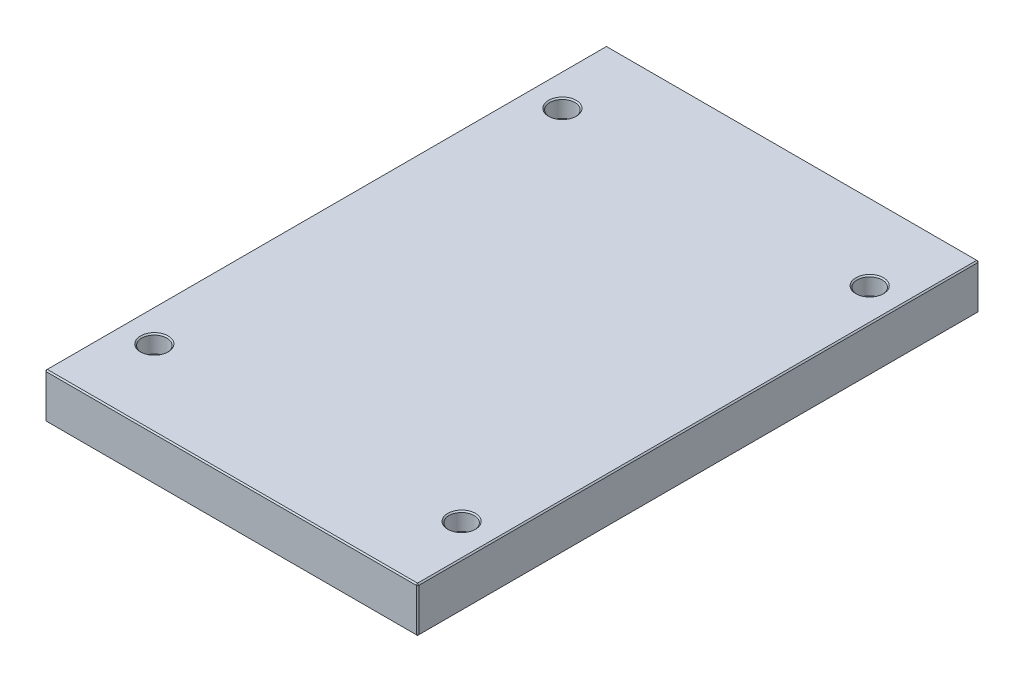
ISO-10303-21;
HEADER;
FILE_DESCRIPTION(('STEP AP214'),'2;1');
FILE_NAME('part.step','',(''),(''),'','','');
FILE_SCHEMA(('AUTOMOTIVE_DESIGN { 1 0 10303 214 1 1 1 1 }'));
ENDSEC;
DATA;
#1=APPLICATION_CONTEXT('core data for automotive mechanical design processes');
#2=APPLICATION_PROTOCOL_DEFINITION('international standard','automotive_design',2000,#1);
#3=PRODUCT_CONTEXT('',#1,'mechanical');
#4=PRODUCT('Part','Part','',(#3));
#5=PRODUCT_RELATED_PRODUCT_CATEGORY('part','',(#4));
#6=PRODUCT_DEFINITION_FORMATION('','',#4);
#7=PRODUCT_DEFINITION_CONTEXT('part definition',#1,'design');
#8=PRODUCT_DEFINITION('design','',#6,#7);
#9=PRODUCT_DEFINITION_SHAPE('','',#8);
#10=(LENGTH_UNIT() NAMED_UNIT(*) SI_UNIT(.MILLI.,.METRE.));
#11=(NAMED_UNIT(*) PLANE_ANGLE_UNIT() SI_UNIT($,.RADIAN.));
#12=(NAMED_UNIT(*) SI_UNIT($,.STERADIAN.) SOLID_ANGLE_UNIT());
#13=UNCERTAINTY_MEASURE_WITH_UNIT(LENGTH_MEASURE(1.E-05),#10,'distance_accuracy_value','');
#14=(GEOMETRIC_REPRESENTATION_CONTEXT(3) GLOBAL_UNCERTAINTY_ASSIGNED_CONTEXT((#13)) GLOBAL_UNIT_ASSIGNED_CONTEXT((#10,
#11,#12)) REPRESENTATION_CONTEXT('',''));
#15=CARTESIAN_POINT('',(0.,0.,0.));
#16=DIRECTION('',(0.,0.,1.));
#17=DIRECTION('',(1.,0.,0.));
#18=AXIS2_PLACEMENT_3D('',#15,#16,#17);
#19=CARTESIAN_POINT('',(-148.,36.,223.));
#20=DIRECTION('',(1.,0.,0.));
#21=DIRECTION('',(0.,0.,-1.));
#22=AXIS2_PLACEMENT_3D('',#19,#20,#21);
#23=PLANE('',#22);
#24=DIRECTION('',(0.,-1.,0.));
#25=VECTOR('',#24,1.);
#26=CARTESIAN_POINT('',(-148.,36.,-222.));
#27=LINE('',#26,#25);
#28=CARTESIAN_POINT('',(-148.,35.,-222.));
#29=VERTEX_POINT('',#28);
#30=CARTESIAN_POINT('',(-148.,1.,-222.));
#31=VERTEX_POINT('',#30);
#32=EDGE_CURVE('E115',#29,#31,#27,.T.);
#33=ORIENTED_EDGE('',*,*,#32,.T.);
#34=DIRECTION('',(0.,0.,1.));
#35=VECTOR('',#34,1.);
#36=CARTESIAN_POINT('',(-148.,1.,223.));
#37=LINE('',#36,#35);
#38=CARTESIAN_POINT('',(-148.,1.,222.));
#39=VERTEX_POINT('',#38);
#40=EDGE_CURVE('E111',#31,#39,#37,.T.);
#41=ORIENTED_EDGE('',*,*,#40,.T.);
#42=DIRECTION('',(0.,1.,0.));
#43=VECTOR('',#42,1.);
#44=CARTESIAN_POINT('',(-148.,36.,222.));
#45=LINE('',#44,#43);
#46=CARTESIAN_POINT('',(-148.,35.,222.));
#47=VERTEX_POINT('',#46);
#48=EDGE_CURVE('E104',#39,#47,#45,.T.);
#49=ORIENTED_EDGE('',*,*,#48,.T.);
#50=DIRECTION('',(0.,0.,-1.));
#51=VECTOR('',#50,1.);
#52=CARTESIAN_POINT('',(-148.,35.,-223.));
#53=LINE('',#52,#51);
#54=EDGE_CURVE('E108',#47,#29,#53,.T.);
#55=ORIENTED_EDGE('',*,*,#54,.T.);
#56=EDGE_LOOP('',(#33,#41,#49,#55));
#57=FACE_BOUND('',#56,.T.);
#58=ADVANCED_FACE('F16',(#57),#23,.F.);
#59=CARTESIAN_POINT('',(148.,36.,223.));
#60=DIRECTION('',(0.,0.,-1.));
#61=DIRECTION('',(-1.,0.,0.));
#62=AXIS2_PLACEMENT_3D('',#59,#60,#61);
#63=PLANE('',#62);
#64=DIRECTION('',(-1.,0.,0.));
#65=VECTOR('',#64,1.);
#66=CARTESIAN_POINT('',(-148.,35.,223.));
#67=LINE('',#66,#65);
#68=CARTESIAN_POINT('',(147.,35.,223.));
#69=VERTEX_POINT('',#68);
#70=CARTESIAN_POINT('',(-147.,35.,223.));
#71=VERTEX_POINT('',#70);
#72=EDGE_CURVE('E170',#69,#71,#67,.T.);
#73=ORIENTED_EDGE('',*,*,#72,.T.);
#74=DIRECTION('',(0.,-1.,0.));
#75=VECTOR('',#74,1.);
#76=CARTESIAN_POINT('',(-147.,36.,223.));
#77=LINE('',#76,#75);
#78=CARTESIAN_POINT('',(-147.,1.00000000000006,223.));
#79=VERTEX_POINT('',#78);
#80=EDGE_CURVE('E123',#71,#79,#77,.T.);
#81=ORIENTED_EDGE('',*,*,#80,.T.);
#82=DIRECTION('',(1.,0.,0.));
#83=VECTOR('',#82,1.);
#84=CARTESIAN_POINT('',(148.,1.00000000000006,223.));
#85=LINE('',#84,#83);
#86=CARTESIAN_POINT('',(147.,1.00000000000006,223.));
#87=VERTEX_POINT('',#86);
#88=EDGE_CURVE('E174',#79,#87,#85,.T.);
#89=ORIENTED_EDGE('',*,*,#88,.T.);
#90=DIRECTION('',(0.,1.,0.));
#91=VECTOR('',#90,1.);
#92=CARTESIAN_POINT('',(147.,36.,223.));
#93=LINE('',#92,#91);
#94=EDGE_CURVE('E172',#87,#69,#93,.T.);
#95=ORIENTED_EDGE('',*,*,#94,.T.);
#96=EDGE_LOOP('',(#73,#81,#89,#95));
#97=FACE_BOUND('',#96,.T.);
#98=ADVANCED_FACE('F317',(#97),#63,.F.);
#99=CARTESIAN_POINT('',(148.,36.,223.));
#100=DIRECTION('',(-1.,0.,0.));
#101=DIRECTION('',(0.,0.,1.));
#102=AXIS2_PLACEMENT_3D('',#99,#100,#101);
#103=PLANE('',#102);
#104=DIRECTION('',(0.,0.,-1.));
#105=VECTOR('',#104,1.);
#106=CARTESIAN_POINT('',(148.,1.00000000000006,223.));
#107=LINE('',#106,#105);
#108=CARTESIAN_POINT('',(148.,1.00000000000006,222.));
#109=VERTEX_POINT('',#108);
#110=CARTESIAN_POINT('',(148.,1.00000000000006,-222.));
#111=VERTEX_POINT('',#110);
#112=EDGE_CURVE('E165',#109,#111,#107,.T.);
#113=ORIENTED_EDGE('',*,*,#112,.T.);
#114=DIRECTION('',(0.,1.,0.));
#115=VECTOR('',#114,1.);
#116=CARTESIAN_POINT('',(148.,36.,-222.));
#117=LINE('',#116,#115);
#118=CARTESIAN_POINT('',(148.,35.,-222.));
#119=VERTEX_POINT('',#118);
#120=EDGE_CURVE('E167',#111,#119,#117,.T.);
#121=ORIENTED_EDGE('',*,*,#120,.T.);
#122=DIRECTION('',(0.,0.,1.));
#123=VECTOR('',#122,1.);
#124=CARTESIAN_POINT('',(148.,35.,223.));
#125=LINE('',#124,#123);
#126=CARTESIAN_POINT('',(148.,35.,222.));
#127=VERTEX_POINT('',#126);
#128=EDGE_CURVE('E161',#119,#127,#125,.T.);
#129=ORIENTED_EDGE('',*,*,#128,.T.);
#130=DIRECTION('',(0.,-1.,0.));
#131=VECTOR('',#130,1.);
#132=CARTESIAN_POINT('',(148.,36.,222.));
#133=LINE('',#132,#131);
#134=EDGE_CURVE('E163',#127,#109,#133,.T.);
#135=ORIENTED_EDGE('',*,*,#134,.T.);
#136=EDGE_LOOP('',(#113,#121,#129,#135));
#137=FACE_BOUND('',#136,.T.);
#138=ADVANCED_FACE('F323',(#137),#103,.F.);
#139=CARTESIAN_POINT('',(148.,36.,-223.));
#140=DIRECTION('',(0.,0.,1.));
#141=DIRECTION('',(1.,0.,0.));
#142=AXIS2_PLACEMENT_3D('',#139,#140,#141);
#143=PLANE('',#142);
#144=DIRECTION('',(0.,-1.,0.));
#145=VECTOR('',#144,1.);
#146=CARTESIAN_POINT('',(147.,36.,-223.));
#147=LINE('',#146,#145);
#148=CARTESIAN_POINT('',(147.,35.,-223.));
#149=VERTEX_POINT('',#148);
#150=CARTESIAN_POINT('',(147.,1.00000000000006,-223.));
#151=VERTEX_POINT('',#150);
#152=EDGE_CURVE('E154',#149,#151,#147,.T.);
#153=ORIENTED_EDGE('',*,*,#152,.T.);
#154=DIRECTION('',(-1.,0.,0.));
#155=VECTOR('',#154,1.);
#156=CARTESIAN_POINT('',(148.,1.00000000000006,-223.));
#157=LINE('',#156,#155);
#158=CARTESIAN_POINT('',(-147.,1.00000000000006,-223.));
#159=VERTEX_POINT('',#158);
#160=EDGE_CURVE('E159',#151,#159,#157,.T.);
#161=ORIENTED_EDGE('',*,*,#160,.T.);
#162=DIRECTION('',(0.,1.,0.));
#163=VECTOR('',#162,1.);
#164=CARTESIAN_POINT('',(-147.,36.,-223.));
#165=LINE('',#164,#163);
#166=CARTESIAN_POINT('',(-147.,35.,-223.));
#167=VERTEX_POINT('',#166);
#168=EDGE_CURVE('E156',#159,#167,#165,.T.);
#169=ORIENTED_EDGE('',*,*,#168,.T.);
#170=DIRECTION('',(1.,0.,0.));
#171=VECTOR('',#170,1.);
#172=CARTESIAN_POINT('',(148.,35.,-223.));
#173=LINE('',#172,#171);
#174=EDGE_CURVE('E152',#167,#149,#173,.T.);
#175=ORIENTED_EDGE('',*,*,#174,.T.);
#176=EDGE_LOOP('',(#153,#161,#169,#175));
#177=FACE_BOUND('',#176,.T.);
#178=ADVANCED_FACE('F465',(#177),#143,.F.);
#179=CARTESIAN_POINT('',(0.,36.,0.));
#180=DIRECTION('',(0.,1.,0.));
#181=DIRECTION('',(0.,0.,1.));
#182=AXIS2_PLACEMENT_3D('',#179,#180,#181);
#183=PLANE('',#182);
#184=CARTESIAN_POINT('',(-122.,36.,162.));
#185=DIRECTION('',(0.,1.,0.));
#186=DIRECTION('',(0.,0.,1.));
#187=AXIS2_PLACEMENT_3D('',#184,#185,#186);
#188=CIRCLE('',#187,11.);
#189=CARTESIAN_POINT('',(-122.,36.,173.));
#190=VERTEX_POINT('',#189);
#191=EDGE_CURVE('E290',#190,#190,#188,.F.);
#192=ORIENTED_EDGE('',*,*,#191,.T.);
#193=EDGE_LOOP('',(#192));
#194=FACE_BOUND('',#193,.T.);
#195=CARTESIAN_POINT('',(122.,36.,162.));
#196=DIRECTION('',(0.,1.,0.));
#197=DIRECTION('',(0.,0.,1.));
#198=AXIS2_PLACEMENT_3D('',#195,#196,#197);
#199=CIRCLE('',#198,11.);
#200=CARTESIAN_POINT('',(122.,36.,173.));
#201=VERTEX_POINT('',#200);
#202=EDGE_CURVE('E287',#201,#201,#199,.F.);
#203=ORIENTED_EDGE('',*,*,#202,.T.);
#204=EDGE_LOOP('',(#203));
#205=FACE_BOUND('',#204,.T.);
#206=CARTESIAN_POINT('',(122.,36.,-162.));
#207=DIRECTION('',(0.,1.,0.));
#208=DIRECTION('',(0.,0.,1.));
#209=AXIS2_PLACEMENT_3D('',#206,#207,#208);
#210=CIRCLE('',#209,11.);
#211=CARTESIAN_POINT('',(122.,36.,-151.));
#212=VERTEX_POINT('',#211);
#213=EDGE_CURVE('E284',#212,#212,#210,.F.);
#214=ORIENTED_EDGE('',*,*,#213,.T.);
#215=EDGE_LOOP('',(#214));
#216=FACE_BOUND('',#215,.T.);
#217=CARTESIAN_POINT('',(-122.,36.,-162.));
#218=DIRECTION('',(0.,1.,0.));
#219=DIRECTION('',(0.,0.,1.));
#220=AXIS2_PLACEMENT_3D('',#217,#218,#219);
#221=CIRCLE('',#220,11.);
#222=CARTESIAN_POINT('',(-122.,36.,-151.));
#223=VERTEX_POINT('',#222);
#224=EDGE_CURVE('E281',#223,#223,#221,.F.);
#225=ORIENTED_EDGE('',*,*,#224,.T.);
#226=EDGE_LOOP('',(#225));
#227=FACE_BOUND('',#226,.T.);
#228=DIRECTION('',(0.,0.,-1.));
#229=VECTOR('',#228,1.);
#230=CARTESIAN_POINT('',(147.,36.,-223.));
#231=LINE('',#230,#229);
#232=CARTESIAN_POINT('',(147.,36.,222.));
#233=VERTEX_POINT('',#232);
#234=CARTESIAN_POINT('',(147.,36.,-222.));
#235=VERTEX_POINT('',#234);
#236=EDGE_CURVE('E31',#233,#235,#231,.T.);
#237=ORIENTED_EDGE('',*,*,#236,.T.);
#238=DIRECTION('',(-1.,0.,0.));
#239=VECTOR('',#238,1.);
#240=CARTESIAN_POINT('',(-148.,36.,-222.));
#241=LINE('',#240,#239);
#242=CARTESIAN_POINT('',(-147.,36.,-222.));
#243=VERTEX_POINT('',#242);
#244=EDGE_CURVE('E190',#235,#243,#241,.T.);
#245=ORIENTED_EDGE('',*,*,#244,.T.);
#246=DIRECTION('',(0.,0.,1.));
#247=VECTOR('',#246,1.);
#248=CARTESIAN_POINT('',(-147.,36.,223.));
#249=LINE('',#248,#247);
#250=CARTESIAN_POINT('',(-147.,36.,222.));
#251=VERTEX_POINT('',#250);
#252=EDGE_CURVE('E186',#243,#251,#249,.T.);
#253=ORIENTED_EDGE('',*,*,#252,.T.);
#254=DIRECTION('',(1.,0.,0.));
#255=VECTOR('',#254,1.);
#256=CARTESIAN_POINT('',(148.,36.,222.));
#257=LINE('',#256,#255);
#258=EDGE_CURVE('E36',#251,#233,#257,.T.);
#259=ORIENTED_EDGE('',*,*,#258,.T.);
#260=EDGE_LOOP('',(#237,#245,#253,#259));
#261=FACE_BOUND('',#260,.T.);
#262=ADVANCED_FACE('F462',(#194,#205,#216,#227,#261),#183,.T.);
#263=CARTESIAN_POINT('',(0.,0.,0.));
#264=DIRECTION('',(0.,1.,0.));
#265=DIRECTION('',(0.,0.,1.));
#266=AXIS2_PLACEMENT_3D('',#263,#264,#265);
#267=PLANE('',#266);
#268=CARTESIAN_POINT('',(122.,0.,-162.));
#269=DIRECTION('',(0.,1.,0.));
#270=DIRECTION('',(0.,0.,1.));
#271=AXIS2_PLACEMENT_3D('',#268,#269,#270);
#272=CIRCLE('',#271,8.);
#273=CARTESIAN_POINT('',(122.,0.,-154.));
#274=VERTEX_POINT('',#273);
#275=EDGE_CURVE('E263',#274,#274,#272,.T.);
#276=ORIENTED_EDGE('',*,*,#275,.T.);
#277=EDGE_LOOP('',(#276));
#278=FACE_BOUND('',#277,.T.);
#279=CARTESIAN_POINT('',(122.,0.,162.));
#280=DIRECTION('',(0.,1.,0.));
#281=DIRECTION('',(0.,0.,1.));
#282=AXIS2_PLACEMENT_3D('',#279,#280,#281);
#283=CIRCLE('',#282,8.);
#284=CARTESIAN_POINT('',(122.,0.,170.));
#285=VERTEX_POINT('',#284);
#286=EDGE_CURVE('E260',#285,#285,#283,.T.);
#287=ORIENTED_EDGE('',*,*,#286,.T.);
#288=EDGE_LOOP('',(#287));
#289=FACE_BOUND('',#288,.T.);
#290=CARTESIAN_POINT('',(-122.,0.,162.));
#291=DIRECTION('',(0.,1.,0.));
#292=DIRECTION('',(0.,0.,1.));
#293=AXIS2_PLACEMENT_3D('',#290,#291,#292);
#294=CIRCLE('',#293,8.);
#295=CARTESIAN_POINT('',(-122.,0.,170.));
#296=VERTEX_POINT('',#295);
#297=EDGE_CURVE('E257',#296,#296,#294,.T.);
#298=ORIENTED_EDGE('',*,*,#297,.T.);
#299=EDGE_LOOP('',(#298));
#300=FACE_BOUND('',#299,.T.);
#301=CARTESIAN_POINT('',(-122.,0.,-162.));
#302=DIRECTION('',(0.,1.,0.));
#303=DIRECTION('',(0.,0.,1.));
#304=AXIS2_PLACEMENT_3D('',#301,#302,#303);
#305=CIRCLE('',#304,8.);
#306=CARTESIAN_POINT('',(-122.,0.,-154.));
#307=VERTEX_POINT('',#306);
#308=EDGE_CURVE('E192',#307,#307,#305,.T.);
#309=ORIENTED_EDGE('',*,*,#308,.T.);
#310=EDGE_LOOP('',(#309));
#311=FACE_BOUND('',#310,.T.);
#312=DIRECTION('',(0.,0.,1.));
#313=VECTOR('',#312,1.);
#314=CARTESIAN_POINT('',(147.,0.,0.));
#315=LINE('',#314,#313);
#316=CARTESIAN_POINT('',(147.,0.,-222.));
#317=VERTEX_POINT('',#316);
#318=CARTESIAN_POINT('',(147.,0.,222.));
#319=VERTEX_POINT('',#318);
#320=EDGE_CURVE('E177',#317,#319,#315,.T.);
#321=ORIENTED_EDGE('',*,*,#320,.T.);
#322=DIRECTION('',(-1.,0.,0.));
#323=VECTOR('',#322,1.);
#324=CARTESIAN_POINT('',(0.,0.,222.));
#325=LINE('',#324,#323);
#326=CARTESIAN_POINT('',(-147.,0.,222.));
#327=VERTEX_POINT('',#326);
#328=EDGE_CURVE('E183',#319,#327,#325,.T.);
#329=ORIENTED_EDGE('',*,*,#328,.T.);
#330=DIRECTION('',(0.,0.,-1.));
#331=VECTOR('',#330,1.);
#332=CARTESIAN_POINT('',(-147.,0.,0.));
#333=LINE('',#332,#331);
#334=CARTESIAN_POINT('',(-147.,0.,-222.));
#335=VERTEX_POINT('',#334);
#336=EDGE_CURVE('E181',#327,#335,#333,.T.);
#337=ORIENTED_EDGE('',*,*,#336,.T.);
#338=DIRECTION('',(1.,0.,0.));
#339=VECTOR('',#338,1.);
#340=CARTESIAN_POINT('',(0.,0.,-222.));
#341=LINE('',#340,#339);
#342=EDGE_CURVE('E179',#335,#317,#341,.T.);
#343=ORIENTED_EDGE('',*,*,#342,.T.);
#344=EDGE_LOOP('',(#321,#329,#337,#343));
#345=FACE_BOUND('',#344,.T.);
#346=ADVANCED_FACE('F402',(#278,#289,#300,#311,#345),#267,.F.);
#347=CARTESIAN_POINT('',(148.,36.,222.));
#348=DIRECTION('',(-0.707106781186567,0.,-0.707106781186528));
#349=DIRECTION('',(0.,-1.,0.));
#350=AXIS2_PLACEMENT_3D('',#347,#348,#349);
#351=PLANE('',#350);
#352=DIRECTION('',(-0.707106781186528,0.,0.707106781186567));
#353=VECTOR('',#352,1.);
#354=CARTESIAN_POINT('',(147.,35.,223.));
#355=LINE('',#354,#353);
#356=EDGE_CURVE('E141',#69,#127,#355,.F.);
#357=ORIENTED_EDGE('',*,*,#356,.F.);
#358=ORIENTED_EDGE('',*,*,#94,.F.);
#359=DIRECTION('',(0.707106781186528,0.,-0.707106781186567));
#360=VECTOR('',#359,1.);
#361=CARTESIAN_POINT('',(147.,1.00000000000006,223.));
#362=LINE('',#361,#360);
#363=EDGE_CURVE('E144',#109,#87,#362,.F.);
#364=ORIENTED_EDGE('',*,*,#363,.F.);
#365=ORIENTED_EDGE('',*,*,#134,.F.);
#366=EDGE_LOOP('',(#357,#358,#364,#365));
#367=FACE_BOUND('',#366,.T.);
#368=ADVANCED_FACE('F398',(#367),#351,.F.);
#369=CARTESIAN_POINT('',(147.,35.,223.));
#370=DIRECTION('',(0.577350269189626,0.577350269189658,0.577350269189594));
#371=DIRECTION('',(-0.707106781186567,0.707106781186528,0.));
#372=AXIS2_PLACEMENT_3D('',#369,#370,#371);
#373=PLANE('',#372);
#374=DIRECTION('',(0.,-0.707106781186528,0.707106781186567));
#375=VECTOR('',#374,1.);
#376=CARTESIAN_POINT('',(147.,35.,223.));
#377=LINE('',#376,#375);
#378=EDGE_CURVE('E235',#69,#233,#377,.F.);
#379=ORIENTED_EDGE('',*,*,#378,.F.);
#380=ORIENTED_EDGE('',*,*,#356,.T.);
#381=DIRECTION('',(-0.707106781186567,0.707106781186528,0.));
#382=VECTOR('',#381,1.);
#383=CARTESIAN_POINT('',(147.5,35.5,222.));
#384=LINE('',#383,#382);
#385=EDGE_CURVE('E237',#233,#127,#384,.F.);
#386=ORIENTED_EDGE('',*,*,#385,.F.);
#387=EDGE_LOOP('',(#379,#380,#386));
#388=FACE_BOUND('',#387,.T.);
#389=ADVANCED_FACE('F394',(#388),#373,.T.);
#390=CARTESIAN_POINT('',(147.,1.00000000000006,223.));
#391=DIRECTION('',(0.577350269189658,-0.577350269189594,0.577350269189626));
#392=DIRECTION('',(0.707106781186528,0.,-0.707106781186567));
#393=AXIS2_PLACEMENT_3D('',#390,#391,#392);
#394=PLANE('',#393);
#395=DIRECTION('',(-0.707106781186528,-0.707106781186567,0.));
#396=VECTOR('',#395,1.);
#397=CARTESIAN_POINT('',(147.5,0.500000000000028,222.));
#398=LINE('',#397,#396);
#399=EDGE_CURVE('E229',#109,#319,#398,.T.);
#400=ORIENTED_EDGE('',*,*,#399,.F.);
#401=ORIENTED_EDGE('',*,*,#363,.T.);
#402=DIRECTION('',(0.,0.707106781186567,0.707106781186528));
#403=VECTOR('',#402,1.);
#404=CARTESIAN_POINT('',(147.,1.00000000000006,223.));
#405=LINE('',#404,#403);
#406=EDGE_CURVE('E232',#319,#87,#405,.T.);
#407=ORIENTED_EDGE('',*,*,#406,.F.);
#408=EDGE_LOOP('',(#400,#401,#407));
#409=FACE_BOUND('',#408,.T.);
#410=ADVANCED_FACE('F390',(#409),#394,.T.);
#411=CARTESIAN_POINT('',(147.,36.,0.));
#412=DIRECTION('',(0.707106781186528,0.707106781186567,0.));
#413=DIRECTION('',(0.,0.,1.));
#414=AXIS2_PLACEMENT_3D('',#411,#412,#413);
#415=PLANE('',#414);
#416=ORIENTED_EDGE('',*,*,#385,.T.);
#417=ORIENTED_EDGE('',*,*,#128,.F.);
#418=DIRECTION('',(0.707106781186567,-0.707106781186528,0.));
#419=VECTOR('',#418,1.);
#420=CARTESIAN_POINT('',(148.,35.,-222.));
#421=LINE('',#420,#419);
#422=EDGE_CURVE('E224',#235,#119,#421,.T.);
#423=ORIENTED_EDGE('',*,*,#422,.F.);
#424=ORIENTED_EDGE('',*,*,#236,.F.);
#425=EDGE_LOOP('',(#416,#417,#423,#424));
#426=FACE_BOUND('',#425,.T.);
#427=ADVANCED_FACE('F386',(#426),#415,.T.);
#428=CARTESIAN_POINT('',(0.,36.,222.));
#429=DIRECTION('',(0.,0.707106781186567,0.707106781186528));
#430=DIRECTION('',(-1.,0.,0.));
#431=AXIS2_PLACEMENT_3D('',#428,#429,#430);
#432=PLANE('',#431);
#433=ORIENTED_EDGE('',*,*,#378,.T.);
#434=ORIENTED_EDGE('',*,*,#258,.F.);
#435=DIRECTION('',(0.,0.707106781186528,-0.707106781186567));
#436=VECTOR('',#435,1.);
#437=CARTESIAN_POINT('',(-147.,35.5,222.5));
#438=LINE('',#437,#436);
#439=EDGE_CURVE('E127',#71,#251,#438,.T.);
#440=ORIENTED_EDGE('',*,*,#439,.F.);
#441=ORIENTED_EDGE('',*,*,#72,.F.);
#442=EDGE_LOOP('',(#433,#434,#440,#441));
#443=FACE_BOUND('',#442,.T.);
#444=ADVANCED_FACE('F383',(#443),#432,.T.);
#445=CARTESIAN_POINT('',(-147.,36.,223.));
#446=DIRECTION('',(0.707106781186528,0.,-0.707106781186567));
#447=DIRECTION('',(0.,-1.,0.));
#448=AXIS2_PLACEMENT_3D('',#445,#446,#447);
#449=PLANE('',#448);
#450=DIRECTION('',(0.707106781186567,0.,0.707106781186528));
#451=VECTOR('',#450,1.);
#452=CARTESIAN_POINT('',(-147.,1.00000000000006,223.));
#453=LINE('',#452,#451);
#454=EDGE_CURVE('E128',#79,#39,#453,.F.);
#455=ORIENTED_EDGE('',*,*,#454,.F.);
#456=ORIENTED_EDGE('',*,*,#80,.F.);
#457=DIRECTION('',(-0.707106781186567,0.,-0.707106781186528));
#458=VECTOR('',#457,1.);
#459=CARTESIAN_POINT('',(-148.,35.,222.));
#460=LINE('',#459,#458);
#461=EDGE_CURVE('E119',#47,#71,#460,.F.);
#462=ORIENTED_EDGE('',*,*,#461,.F.);
#463=ORIENTED_EDGE('',*,*,#48,.F.);
#464=EDGE_LOOP('',(#455,#456,#462,#463));
#465=FACE_BOUND('',#464,.T.);
#466=ADVANCED_FACE('F121',(#465),#449,.F.);
#467=CARTESIAN_POINT('',(148.,1.00000000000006,223.));
#468=DIRECTION('',(0.,0.707106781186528,-0.707106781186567));
#469=DIRECTION('',(1.,0.,0.));
#470=AXIS2_PLACEMENT_3D('',#467,#468,#469);
#471=PLANE('',#470);
#472=ORIENTED_EDGE('',*,*,#406,.T.);
#473=ORIENTED_EDGE('',*,*,#88,.F.);
#474=DIRECTION('',(0.,-0.707106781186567,-0.707106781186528));
#475=VECTOR('',#474,1.);
#476=CARTESIAN_POINT('',(-147.,1.00000000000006,223.));
#477=LINE('',#476,#475);
#478=EDGE_CURVE('E220',#327,#79,#477,.F.);
#479=ORIENTED_EDGE('',*,*,#478,.F.);
#480=ORIENTED_EDGE('',*,*,#328,.F.);
#481=EDGE_LOOP('',(#472,#473,#479,#480));
#482=FACE_BOUND('',#481,.T.);
#483=ADVANCED_FACE('F376',(#482),#471,.F.);
#484=CARTESIAN_POINT('',(148.,1.00000000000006,223.));
#485=DIRECTION('',(-0.707106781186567,0.707106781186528,0.));
#486=DIRECTION('',(0.,0.,-1.));
#487=AXIS2_PLACEMENT_3D('',#484,#485,#486);
#488=PLANE('',#487);
#489=ORIENTED_EDGE('',*,*,#399,.T.);
#490=ORIENTED_EDGE('',*,*,#320,.F.);
#491=DIRECTION('',(0.707106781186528,0.707106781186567,0.));
#492=VECTOR('',#491,1.);
#493=CARTESIAN_POINT('',(147.5,0.500000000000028,-222.));
#494=LINE('',#493,#492);
#495=EDGE_CURVE('E217',#111,#317,#494,.F.);
#496=ORIENTED_EDGE('',*,*,#495,.F.);
#497=ORIENTED_EDGE('',*,*,#112,.F.);
#498=EDGE_LOOP('',(#489,#490,#496,#497));
#499=FACE_BOUND('',#498,.T.);
#500=ADVANCED_FACE('F372',(#499),#488,.F.);
#501=CARTESIAN_POINT('',(147.,36.,-223.));
#502=DIRECTION('',(-0.707106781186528,0.,0.707106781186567));
#503=DIRECTION('',(0.,-1.,0.));
#504=AXIS2_PLACEMENT_3D('',#501,#502,#503);
#505=PLANE('',#504);
#506=DIRECTION('',(0.707106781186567,0.,0.707106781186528));
#507=VECTOR('',#506,1.);
#508=CARTESIAN_POINT('',(148.,35.,-222.));
#509=LINE('',#508,#507);
#510=EDGE_CURVE('E226',#119,#149,#509,.F.);
#511=ORIENTED_EDGE('',*,*,#510,.F.);
#512=ORIENTED_EDGE('',*,*,#120,.F.);
#513=DIRECTION('',(-0.707106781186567,0.,-0.707106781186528));
#514=VECTOR('',#513,1.);
#515=CARTESIAN_POINT('',(147.,1.00000000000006,-223.));
#516=LINE('',#515,#514);
#517=EDGE_CURVE('E214',#151,#111,#516,.F.);
#518=ORIENTED_EDGE('',*,*,#517,.F.);
#519=ORIENTED_EDGE('',*,*,#152,.F.);
#520=EDGE_LOOP('',(#511,#512,#518,#519));
#521=FACE_BOUND('',#520,.T.);
#522=ADVANCED_FACE('F368',(#521),#505,.F.);
#523=CARTESIAN_POINT('',(148.,35.,-222.));
#524=DIRECTION('',(0.577350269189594,0.577350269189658,-0.577350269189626));
#525=DIRECTION('',(0.,0.707106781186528,0.707106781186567));
#526=AXIS2_PLACEMENT_3D('',#523,#524,#525);
#527=PLANE('',#526);
#528=ORIENTED_EDGE('',*,*,#422,.T.);
#529=ORIENTED_EDGE('',*,*,#510,.T.);
#530=DIRECTION('',(0.,0.707106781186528,0.707106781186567));
#531=VECTOR('',#530,1.);
#532=CARTESIAN_POINT('',(147.,35.5,-222.5));
#533=LINE('',#532,#531);
#534=EDGE_CURVE('E135',#235,#149,#533,.F.);
#535=ORIENTED_EDGE('',*,*,#534,.F.);
#536=EDGE_LOOP('',(#528,#529,#535));
#537=FACE_BOUND('',#536,.T.);
#538=ADVANCED_FACE('F365',(#537),#527,.T.);
#539=CARTESIAN_POINT('',(-148.,35.,222.));
#540=DIRECTION('',(-0.577350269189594,0.577350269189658,0.577350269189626));
#541=DIRECTION('',(0.,-0.707106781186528,0.707106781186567));
#542=AXIS2_PLACEMENT_3D('',#539,#540,#541);
#543=PLANE('',#542);
#544=ORIENTED_EDGE('',*,*,#461,.T.);
#545=ORIENTED_EDGE('',*,*,#439,.T.);
#546=DIRECTION('',(-0.707106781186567,-0.707106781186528,0.));
#547=VECTOR('',#546,1.);
#548=CARTESIAN_POINT('',(-148.,35.,222.));
#549=LINE('',#548,#547);
#550=EDGE_CURVE('E131',#47,#251,#549,.F.);
#551=ORIENTED_EDGE('',*,*,#550,.F.);
#552=EDGE_LOOP('',(#544,#545,#551));
#553=FACE_BOUND('',#552,.T.);
#554=ADVANCED_FACE('F132',(#553),#543,.T.);
#555=CARTESIAN_POINT('',(-147.,1.00000000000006,223.));
#556=DIRECTION('',(-0.577350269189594,-0.577350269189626,0.577350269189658));
#557=DIRECTION('',(0.,-0.707106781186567,-0.707106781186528));
#558=AXIS2_PLACEMENT_3D('',#555,#556,#557);
#559=PLANE('',#558);
#560=ORIENTED_EDGE('',*,*,#478,.T.);
#561=ORIENTED_EDGE('',*,*,#454,.T.);
#562=DIRECTION('',(-0.707106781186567,0.707106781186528,0.));
#563=VECTOR('',#562,1.);
#564=CARTESIAN_POINT('',(-147.5,0.5,222.));
#565=LINE('',#564,#563);
#566=EDGE_CURVE('E136',#327,#39,#565,.T.);
#567=ORIENTED_EDGE('',*,*,#566,.F.);
#568=EDGE_LOOP('',(#560,#561,#567));
#569=FACE_BOUND('',#568,.T.);
#570=ADVANCED_FACE('F358',(#569),#559,.T.);
#571=CARTESIAN_POINT('',(147.,1.00000000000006,-223.));
#572=DIRECTION('',(0.577350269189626,-0.577350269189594,-0.577350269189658));
#573=DIRECTION('',(-0.707106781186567,0.,-0.707106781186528));
#574=AXIS2_PLACEMENT_3D('',#571,#572,#573);
#575=PLANE('',#574);
#576=ORIENTED_EDGE('',*,*,#517,.T.);
#577=ORIENTED_EDGE('',*,*,#495,.T.);
#578=DIRECTION('',(0.,-0.707106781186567,0.707106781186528));
#579=VECTOR('',#578,1.);
#580=CARTESIAN_POINT('',(147.,1.00000000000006,-223.));
#581=LINE('',#580,#579);
#582=EDGE_CURVE('E207',#151,#317,#581,.T.);
#583=ORIENTED_EDGE('',*,*,#582,.F.);
#584=EDGE_LOOP('',(#576,#577,#583));
#585=FACE_BOUND('',#584,.T.);
#586=ADVANCED_FACE('F354',(#585),#575,.T.);
#587=CARTESIAN_POINT('',(0.,36.,-222.));
#588=DIRECTION('',(0.,0.707106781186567,-0.707106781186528));
#589=DIRECTION('',(1.,0.,0.));
#590=AXIS2_PLACEMENT_3D('',#587,#588,#589);
#591=PLANE('',#590);
#592=ORIENTED_EDGE('',*,*,#534,.T.);
#593=ORIENTED_EDGE('',*,*,#174,.F.);
#594=DIRECTION('',(0.,-0.707106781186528,-0.707106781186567));
#595=VECTOR('',#594,1.);
#596=CARTESIAN_POINT('',(-147.,35.,-223.));
#597=LINE('',#596,#595);
#598=EDGE_CURVE('E204',#243,#167,#597,.T.);
#599=ORIENTED_EDGE('',*,*,#598,.F.);
#600=ORIENTED_EDGE('',*,*,#244,.F.);
#601=EDGE_LOOP('',(#592,#593,#599,#600));
#602=FACE_BOUND('',#601,.T.);
#603=ADVANCED_FACE('F351',(#602),#591,.T.);
#604=CARTESIAN_POINT('',(-147.,36.,0.));
#605=DIRECTION('',(-0.707106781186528,0.707106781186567,0.));
#606=DIRECTION('',(0.,0.,-1.));
#607=AXIS2_PLACEMENT_3D('',#604,#605,#606);
#608=PLANE('',#607);
#609=ORIENTED_EDGE('',*,*,#550,.T.);
#610=ORIENTED_EDGE('',*,*,#252,.F.);
#611=DIRECTION('',(0.707106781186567,0.707106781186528,0.));
#612=VECTOR('',#611,1.);
#613=CARTESIAN_POINT('',(-147.5,35.5,-222.));
#614=LINE('',#613,#612);
#615=EDGE_CURVE('E139',#29,#243,#614,.T.);
#616=ORIENTED_EDGE('',*,*,#615,.F.);
#617=ORIENTED_EDGE('',*,*,#54,.F.);
#618=EDGE_LOOP('',(#609,#610,#616,#617));
#619=FACE_BOUND('',#618,.T.);
#620=ADVANCED_FACE('F138',(#619),#608,.T.);
#621=CARTESIAN_POINT('',(-148.,1.,223.));
#622=DIRECTION('',(0.707106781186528,0.707106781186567,0.));
#623=DIRECTION('',(0.,0.,1.));
#624=AXIS2_PLACEMENT_3D('',#621,#622,#623);
#625=PLANE('',#624);
#626=ORIENTED_EDGE('',*,*,#566,.T.);
#627=ORIENTED_EDGE('',*,*,#40,.F.);
#628=DIRECTION('',(0.707106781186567,-0.707106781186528,0.));
#629=VECTOR('',#628,1.);
#630=CARTESIAN_POINT('',(-148.,1.,-222.));
#631=LINE('',#630,#629);
#632=EDGE_CURVE('E200',#335,#31,#631,.F.);
#633=ORIENTED_EDGE('',*,*,#632,.F.);
#634=ORIENTED_EDGE('',*,*,#336,.F.);
#635=EDGE_LOOP('',(#626,#627,#633,#634));
#636=FACE_BOUND('',#635,.T.);
#637=ADVANCED_FACE('F344',(#636),#625,.F.);
#638=CARTESIAN_POINT('',(148.,1.00000000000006,-223.));
#639=DIRECTION('',(0.,0.707106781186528,0.707106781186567));
#640=DIRECTION('',(-1.,0.,0.));
#641=AXIS2_PLACEMENT_3D('',#638,#639,#640);
#642=PLANE('',#641);
#643=ORIENTED_EDGE('',*,*,#582,.T.);
#644=ORIENTED_EDGE('',*,*,#342,.F.);
#645=DIRECTION('',(0.,0.707106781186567,-0.707106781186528));
#646=VECTOR('',#645,1.);
#647=CARTESIAN_POINT('',(-147.,0.500000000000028,-222.5));
#648=LINE('',#647,#646);
#649=EDGE_CURVE('E197',#159,#335,#648,.F.);
#650=ORIENTED_EDGE('',*,*,#649,.F.);
#651=ORIENTED_EDGE('',*,*,#160,.F.);
#652=EDGE_LOOP('',(#643,#644,#650,#651));
#653=FACE_BOUND('',#652,.T.);
#654=ADVANCED_FACE('F340',(#653),#642,.F.);
#655=CARTESIAN_POINT('',(-147.,35.,-223.));
#656=DIRECTION('',(-0.577350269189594,0.577350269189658,-0.577350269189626));
#657=DIRECTION('',(0.,0.707106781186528,0.707106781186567));
#658=AXIS2_PLACEMENT_3D('',#655,#656,#657);
#659=PLANE('',#658);
#660=ORIENTED_EDGE('',*,*,#615,.T.);
#661=ORIENTED_EDGE('',*,*,#598,.T.);
#662=DIRECTION('',(0.707106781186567,0.,-0.707106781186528));
#663=VECTOR('',#662,1.);
#664=CARTESIAN_POINT('',(-147.,35.,-223.));
#665=LINE('',#664,#663);
#666=EDGE_CURVE('E195',#29,#167,#665,.T.);
#667=ORIENTED_EDGE('',*,*,#666,.F.);
#668=EDGE_LOOP('',(#660,#661,#667));
#669=FACE_BOUND('',#668,.T.);
#670=ADVANCED_FACE('F336',(#669),#659,.T.);
#671=CARTESIAN_POINT('',(-148.,1.,-222.));
#672=DIRECTION('',(-0.577350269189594,-0.577350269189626,-0.577350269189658));
#673=DIRECTION('',(0.,0.707106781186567,-0.707106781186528));
#674=AXIS2_PLACEMENT_3D('',#671,#672,#673);
#675=PLANE('',#674);
#676=ORIENTED_EDGE('',*,*,#649,.T.);
#677=ORIENTED_EDGE('',*,*,#632,.T.);
#678=DIRECTION('',(-0.707106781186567,0.,0.707106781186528));
#679=VECTOR('',#678,1.);
#680=CARTESIAN_POINT('',(-148.,1.,-222.));
#681=LINE('',#680,#679);
#682=EDGE_CURVE('E193',#159,#31,#681,.T.);
#683=ORIENTED_EDGE('',*,*,#682,.F.);
#684=EDGE_LOOP('',(#676,#677,#683));
#685=FACE_BOUND('',#684,.T.);
#686=ADVANCED_FACE('F332',(#685),#675,.T.);
#687=CARTESIAN_POINT('',(-148.,36.,-222.));
#688=DIRECTION('',(0.707106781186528,0.,0.707106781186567));
#689=DIRECTION('',(0.,-1.,0.));
#690=AXIS2_PLACEMENT_3D('',#687,#688,#689);
#691=PLANE('',#690);
#692=ORIENTED_EDGE('',*,*,#666,.T.);
#693=ORIENTED_EDGE('',*,*,#168,.F.);
#694=ORIENTED_EDGE('',*,*,#682,.T.);
#695=ORIENTED_EDGE('',*,*,#32,.F.);
#696=EDGE_LOOP('',(#692,#693,#694,#695));
#697=FACE_BOUND('',#696,.T.);
#698=ADVANCED_FACE('F328',(#697),#691,.F.);
#699=CARTESIAN_POINT('',(-122.,22.,-162.));
#700=DIRECTION('',(0.,1.,0.));
#701=DIRECTION('',(0.,0.,1.));
#702=AXIS2_PLACEMENT_3D('',#699,#700,#701);
#703=CYLINDRICAL_SURFACE('',#702,10.);
#704=CARTESIAN_POINT('',(-122.,35.,-162.));
#705=DIRECTION('',(0.,1.,0.));
#706=DIRECTION('',(0.,0.,1.));
#707=AXIS2_PLACEMENT_3D('',#704,#705,#706);
#708=CIRCLE('',#707,10.);
#709=CARTESIAN_POINT('',(-122.,35.,-152.));
#710=VERTEX_POINT('',#709);
#711=EDGE_CURVE('E10',#710,#710,#708,.T.);
#712=ORIENTED_EDGE('',*,*,#711,.T.);
#713=EDGE_LOOP('',(#712));
#714=FACE_BOUND('',#713,.T.);
#715=CARTESIAN_POINT('',(-122.,22.,-162.));
#716=DIRECTION('',(0.,1.,0.));
#717=DIRECTION('',(0.,0.,1.));
#718=AXIS2_PLACEMENT_3D('',#715,#716,#717);
#719=CIRCLE('',#718,10.);
#720=CARTESIAN_POINT('',(-122.,22.,-152.));
#721=VERTEX_POINT('',#720);
#722=EDGE_CURVE('E147',#721,#721,#719,.T.);
#723=ORIENTED_EDGE('',*,*,#722,.F.);
#724=EDGE_LOOP('',(#723));
#725=FACE_BOUND('',#724,.T.);
#726=ADVANCED_FACE('F331',(#714,#725),#703,.F.);
#727=CARTESIAN_POINT('',(-122.,22.,-162.));
#728=DIRECTION('',(0.,1.,0.));
#729=DIRECTION('',(0.,0.,1.));
#730=AXIS2_PLACEMENT_3D('',#727,#728,#729);
#731=PLANE('',#730);
#732=CARTESIAN_POINT('',(-122.,22.,-162.));
#733=DIRECTION('',(0.,1.,0.));
#734=DIRECTION('',(0.,0.,1.));
#735=AXIS2_PLACEMENT_3D('',#732,#733,#734);
#736=CIRCLE('',#735,7.);
#737=CARTESIAN_POINT('',(-122.,22.,-155.));
#738=VERTEX_POINT('',#737);
#739=EDGE_CURVE('E251',#738,#738,#736,.T.);
#740=ORIENTED_EDGE('',*,*,#739,.F.);
#741=EDGE_LOOP('',(#740));
#742=FACE_BOUND('',#741,.T.);
#743=ORIENTED_EDGE('',*,*,#722,.T.);
#744=EDGE_LOOP('',(#743));
#745=FACE_BOUND('',#744,.T.);
#746=ADVANCED_FACE('F450',(#742,#745),#731,.T.);
#747=CARTESIAN_POINT('',(122.,22.,-162.));
#748=DIRECTION('',(0.,1.,0.));
#749=DIRECTION('',(0.,0.,1.));
#750=AXIS2_PLACEMENT_3D('',#747,#748,#749);
#751=CYLINDRICAL_SURFACE('',#750,10.);
#752=CARTESIAN_POINT('',(122.,35.,-162.));
#753=DIRECTION('',(0.,1.,0.));
#754=DIRECTION('',(0.,0.,1.));
#755=AXIS2_PLACEMENT_3D('',#752,#753,#754);
#756=CIRCLE('',#755,10.);
#757=CARTESIAN_POINT('',(122.,35.,-152.));
#758=VERTEX_POINT('',#757);
#759=EDGE_CURVE('E24',#758,#758,#756,.T.);
#760=ORIENTED_EDGE('',*,*,#759,.T.);
#761=EDGE_LOOP('',(#760));
#762=FACE_BOUND('',#761,.T.);
#763=CARTESIAN_POINT('',(122.,22.,-162.));
#764=DIRECTION('',(0.,1.,0.));
#765=DIRECTION('',(0.,0.,1.));
#766=AXIS2_PLACEMENT_3D('',#763,#764,#765);
#767=CIRCLE('',#766,10.);
#768=CARTESIAN_POINT('',(122.,22.,-152.));
#769=VERTEX_POINT('',#768);
#770=EDGE_CURVE('E441',#769,#769,#767,.T.);
#771=ORIENTED_EDGE('',*,*,#770,.F.);
#772=EDGE_LOOP('',(#771));
#773=FACE_BOUND('',#772,.T.);
#774=ADVANCED_FACE('F298',(#762,#773),#751,.F.);
#775=CARTESIAN_POINT('',(122.,22.,-162.));
#776=DIRECTION('',(0.,1.,0.));
#777=DIRECTION('',(0.,0.,1.));
#778=AXIS2_PLACEMENT_3D('',#775,#776,#777);
#779=PLANE('',#778);
#780=CARTESIAN_POINT('',(122.,22.,-162.));
#781=DIRECTION('',(0.,1.,0.));
#782=DIRECTION('',(0.,0.,1.));
#783=AXIS2_PLACEMENT_3D('',#780,#781,#782);
#784=CIRCLE('',#783,7.);
#785=CARTESIAN_POINT('',(122.,22.,-155.));
#786=VERTEX_POINT('',#785);
#787=EDGE_CURVE('E248',#786,#786,#784,.T.);
#788=ORIENTED_EDGE('',*,*,#787,.F.);
#789=EDGE_LOOP('',(#788));
#790=FACE_BOUND('',#789,.T.);
#791=ORIENTED_EDGE('',*,*,#770,.T.);
#792=EDGE_LOOP('',(#791));
#793=FACE_BOUND('',#792,.T.);
#794=ADVANCED_FACE('F738',(#790,#793),#779,.T.);
#795=CARTESIAN_POINT('',(122.,22.,162.));
#796=DIRECTION('',(0.,1.,0.));
#797=DIRECTION('',(0.,0.,1.));
#798=AXIS2_PLACEMENT_3D('',#795,#796,#797);
#799=CYLINDRICAL_SURFACE('',#798,10.);
#800=CARTESIAN_POINT('',(122.,35.,162.));
#801=DIRECTION('',(0.,1.,0.));
#802=DIRECTION('',(0.,0.,1.));
#803=AXIS2_PLACEMENT_3D('',#800,#801,#802);
#804=CIRCLE('',#803,10.);
#805=CARTESIAN_POINT('',(122.,35.,172.));
#806=VERTEX_POINT('',#805);
#807=EDGE_CURVE('E293',#806,#806,#804,.T.);
#808=ORIENTED_EDGE('',*,*,#807,.T.);
#809=EDGE_LOOP('',(#808));
#810=FACE_BOUND('',#809,.T.);
#811=CARTESIAN_POINT('',(122.,22.,162.));
#812=DIRECTION('',(0.,1.,0.));
#813=DIRECTION('',(0.,0.,1.));
#814=AXIS2_PLACEMENT_3D('',#811,#812,#813);
#815=CIRCLE('',#814,10.);
#816=CARTESIAN_POINT('',(122.,22.,172.));
#817=VERTEX_POINT('',#816);
#818=EDGE_CURVE('E439',#817,#817,#815,.T.);
#819=ORIENTED_EDGE('',*,*,#818,.F.);
#820=EDGE_LOOP('',(#819));
#821=FACE_BOUND('',#820,.T.);
#822=ADVANCED_FACE('F730',(#810,#821),#799,.F.);
#823=CARTESIAN_POINT('',(122.,22.,162.));
#824=DIRECTION('',(0.,1.,0.));
#825=DIRECTION('',(0.,0.,1.));
#826=AXIS2_PLACEMENT_3D('',#823,#824,#825);
#827=PLANE('',#826);
#828=CARTESIAN_POINT('',(122.,22.,162.));
#829=DIRECTION('',(0.,1.,0.));
#830=DIRECTION('',(0.,0.,1.));
#831=AXIS2_PLACEMENT_3D('',#828,#829,#830);
#832=CIRCLE('',#831,7.);
#833=CARTESIAN_POINT('',(122.,22.,169.));
#834=VERTEX_POINT('',#833);
#835=EDGE_CURVE('E245',#834,#834,#832,.T.);
#836=ORIENTED_EDGE('',*,*,#835,.F.);
#837=EDGE_LOOP('',(#836));
#838=FACE_BOUND('',#837,.T.);
#839=ORIENTED_EDGE('',*,*,#818,.T.);
#840=EDGE_LOOP('',(#839));
#841=FACE_BOUND('',#840,.T.);
#842=ADVANCED_FACE('F434',(#838,#841),#827,.T.);
#843=CARTESIAN_POINT('',(-122.,22.,162.));
#844=DIRECTION('',(0.,1.,0.));
#845=DIRECTION('',(0.,0.,1.));
#846=AXIS2_PLACEMENT_3D('',#843,#844,#845);
#847=CYLINDRICAL_SURFACE('',#846,10.);
#848=CARTESIAN_POINT('',(-122.,35.,162.));
#849=DIRECTION('',(0.,1.,0.));
#850=DIRECTION('',(0.,0.,1.));
#851=AXIS2_PLACEMENT_3D('',#848,#849,#850);
#852=CIRCLE('',#851,10.);
#853=CARTESIAN_POINT('',(-122.,35.,172.));
#854=VERTEX_POINT('',#853);
#855=EDGE_CURVE('E278',#854,#854,#852,.T.);
#856=ORIENTED_EDGE('',*,*,#855,.T.);
#857=EDGE_LOOP('',(#856));
#858=FACE_BOUND('',#857,.T.);
#859=CARTESIAN_POINT('',(-122.,22.,162.));
#860=DIRECTION('',(0.,1.,0.));
#861=DIRECTION('',(0.,0.,1.));
#862=AXIS2_PLACEMENT_3D('',#859,#860,#861);
#863=CIRCLE('',#862,10.);
#864=CARTESIAN_POINT('',(-122.,22.,172.));
#865=VERTEX_POINT('',#864);
#866=EDGE_CURVE('E254',#865,#865,#863,.T.);
#867=ORIENTED_EDGE('',*,*,#866,.F.);
#868=EDGE_LOOP('',(#867));
#869=FACE_BOUND('',#868,.T.);
#870=ADVANCED_FACE('F430',(#858,#869),#847,.F.);
#871=CARTESIAN_POINT('',(-122.,22.,162.));
#872=DIRECTION('',(0.,1.,0.));
#873=DIRECTION('',(0.,0.,1.));
#874=AXIS2_PLACEMENT_3D('',#871,#872,#873);
#875=PLANE('',#874);
#876=CARTESIAN_POINT('',(-122.,22.,162.));
#877=DIRECTION('',(0.,1.,0.));
#878=DIRECTION('',(0.,0.,1.));
#879=AXIS2_PLACEMENT_3D('',#876,#877,#878);
#880=CIRCLE('',#879,7.);
#881=CARTESIAN_POINT('',(-122.,22.,169.));
#882=VERTEX_POINT('',#881);
#883=EDGE_CURVE('E242',#882,#882,#880,.T.);
#884=ORIENTED_EDGE('',*,*,#883,.F.);
#885=EDGE_LOOP('',(#884));
#886=FACE_BOUND('',#885,.T.);
#887=ORIENTED_EDGE('',*,*,#866,.T.);
#888=EDGE_LOOP('',(#887));
#889=FACE_BOUND('',#888,.T.);
#890=ADVANCED_FACE('F433',(#886,#889),#875,.T.);
#891=CARTESIAN_POINT('',(-122.,0.,162.));
#892=DIRECTION('',(0.,1.,0.));
#893=DIRECTION('',(0.,0.,1.));
#894=AXIS2_PLACEMENT_3D('',#891,#892,#893);
#895=CYLINDRICAL_SURFACE('',#894,7.);
#896=CARTESIAN_POINT('',(-122.,1.00000000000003,162.));
#897=DIRECTION('',(0.,1.,0.));
#898=DIRECTION('',(0.,0.,1.));
#899=AXIS2_PLACEMENT_3D('',#896,#897,#898);
#900=CIRCLE('',#899,7.);
#901=CARTESIAN_POINT('',(-122.,1.00000000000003,169.));
#902=VERTEX_POINT('',#901);
#903=EDGE_CURVE('E272',#902,#902,#900,.F.);
#904=ORIENTED_EDGE('',*,*,#903,.T.);
#905=EDGE_LOOP('',(#904));
#906=FACE_BOUND('',#905,.T.);
#907=ORIENTED_EDGE('',*,*,#883,.T.);
#908=EDGE_LOOP('',(#907));
#909=FACE_BOUND('',#908,.T.);
#910=ADVANCED_FACE('F705',(#906,#909),#895,.F.);
#911=CARTESIAN_POINT('',(122.,0.,162.));
#912=DIRECTION('',(0.,1.,0.));
#913=DIRECTION('',(0.,0.,1.));
#914=AXIS2_PLACEMENT_3D('',#911,#912,#913);
#915=CYLINDRICAL_SURFACE('',#914,7.);
#916=CARTESIAN_POINT('',(122.,0.999999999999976,162.));
#917=DIRECTION('',(0.,1.,0.));
#918=DIRECTION('',(0.,0.,1.));
#919=AXIS2_PLACEMENT_3D('',#916,#917,#918);
#920=CIRCLE('',#919,7.);
#921=CARTESIAN_POINT('',(122.,0.999999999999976,169.));
#922=VERTEX_POINT('',#921);
#923=EDGE_CURVE('E269',#922,#922,#920,.F.);
#924=ORIENTED_EDGE('',*,*,#923,.T.);
#925=EDGE_LOOP('',(#924));
#926=FACE_BOUND('',#925,.T.);
#927=ORIENTED_EDGE('',*,*,#835,.T.);
#928=EDGE_LOOP('',(#927));
#929=FACE_BOUND('',#928,.T.);
#930=ADVANCED_FACE('F697',(#926,#929),#915,.F.);
#931=CARTESIAN_POINT('',(122.,0.,-162.));
#932=DIRECTION('',(0.,1.,0.));
#933=DIRECTION('',(0.,0.,1.));
#934=AXIS2_PLACEMENT_3D('',#931,#932,#933);
#935=CYLINDRICAL_SURFACE('',#934,7.);
#936=CARTESIAN_POINT('',(122.,0.999999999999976,-162.));
#937=DIRECTION('',(0.,1.,0.));
#938=DIRECTION('',(0.,0.,1.));
#939=AXIS2_PLACEMENT_3D('',#936,#937,#938);
#940=CIRCLE('',#939,7.);
#941=CARTESIAN_POINT('',(122.,0.999999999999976,-155.));
#942=VERTEX_POINT('',#941);
#943=EDGE_CURVE('E266',#942,#942,#940,.F.);
#944=ORIENTED_EDGE('',*,*,#943,.T.);
#945=EDGE_LOOP('',(#944));
#946=FACE_BOUND('',#945,.T.);
#947=ORIENTED_EDGE('',*,*,#787,.T.);
#948=EDGE_LOOP('',(#947));
#949=FACE_BOUND('',#948,.T.);
#950=ADVANCED_FACE('F688',(#946,#949),#935,.F.);
#951=CARTESIAN_POINT('',(-122.,0.,-162.));
#952=DIRECTION('',(0.,1.,0.));
#953=DIRECTION('',(0.,0.,1.));
#954=AXIS2_PLACEMENT_3D('',#951,#952,#953);
#955=CYLINDRICAL_SURFACE('',#954,7.);
#956=CARTESIAN_POINT('',(-122.,1.00000000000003,-162.));
#957=DIRECTION('',(0.,1.,0.));
#958=DIRECTION('',(0.,0.,1.));
#959=AXIS2_PLACEMENT_3D('',#956,#957,#958);
#960=CIRCLE('',#959,7.);
#961=CARTESIAN_POINT('',(-122.,1.00000000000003,-155.));
#962=VERTEX_POINT('',#961);
#963=EDGE_CURVE('E275',#962,#962,#960,.F.);
#964=ORIENTED_EDGE('',*,*,#963,.T.);
#965=EDGE_LOOP('',(#964));
#966=FACE_BOUND('',#965,.T.);
#967=ORIENTED_EDGE('',*,*,#739,.T.);
#968=EDGE_LOOP('',(#967));
#969=FACE_BOUND('',#968,.T.);
#970=ADVANCED_FACE('F408',(#966,#969),#955,.F.);
#971=CARTESIAN_POINT('',(122.,0.,-162.));
#972=DIRECTION('',(0.,-1.,0.));
#973=DIRECTION('',(0.,0.,-1.));
#974=AXIS2_PLACEMENT_3D('',#971,#972,#973);
#975=CONICAL_SURFACE('',#974,8.,0.785398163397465);
#976=ORIENTED_EDGE('',*,*,#943,.F.);
#977=EDGE_LOOP('',(#976));
#978=FACE_BOUND('',#977,.T.);
#979=ORIENTED_EDGE('',*,*,#275,.F.);
#980=EDGE_LOOP('',(#979));
#981=FACE_BOUND('',#980,.T.);
#982=ADVANCED_FACE('F404',(#978,#981),#975,.F.);
#983=CARTESIAN_POINT('',(122.,0.,162.));
#984=DIRECTION('',(0.,-1.,0.));
#985=DIRECTION('',(0.,0.,-1.));
#986=AXIS2_PLACEMENT_3D('',#983,#984,#985);
#987=CONICAL_SURFACE('',#986,8.,0.785398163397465);
#988=ORIENTED_EDGE('',*,*,#923,.F.);
#989=EDGE_LOOP('',(#988));
#990=FACE_BOUND('',#989,.T.);
#991=ORIENTED_EDGE('',*,*,#286,.F.);
#992=EDGE_LOOP('',(#991));
#993=FACE_BOUND('',#992,.T.);
#994=ADVANCED_FACE('F407',(#990,#993),#987,.F.);
#995=CARTESIAN_POINT('',(-122.,0.,162.));
#996=DIRECTION('',(0.,-1.,0.));
#997=DIRECTION('',(0.,0.,-1.));
#998=AXIS2_PLACEMENT_3D('',#995,#996,#997);
#999=CONICAL_SURFACE('',#998,8.,0.785398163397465);
#1000=ORIENTED_EDGE('',*,*,#903,.F.);
#1001=EDGE_LOOP('',(#1000));
#1002=FACE_BOUND('',#1001,.T.);
#1003=ORIENTED_EDGE('',*,*,#297,.F.);
#1004=EDGE_LOOP('',(#1003));
#1005=FACE_BOUND('',#1004,.T.);
#1006=ADVANCED_FACE('F412',(#1002,#1005),#999,.F.);
#1007=CARTESIAN_POINT('',(-122.,0.,-162.));
#1008=DIRECTION('',(0.,-1.,0.));
#1009=DIRECTION('',(0.,0.,-1.));
#1010=AXIS2_PLACEMENT_3D('',#1007,#1008,#1009);
#1011=CONICAL_SURFACE('',#1010,8.,0.785398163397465);
#1012=ORIENTED_EDGE('',*,*,#963,.F.);
#1013=EDGE_LOOP('',(#1012));
#1014=FACE_BOUND('',#1013,.T.);
#1015=ORIENTED_EDGE('',*,*,#308,.F.);
#1016=EDGE_LOOP('',(#1015));
#1017=FACE_BOUND('',#1016,.T.);
#1018=ADVANCED_FACE('F416',(#1014,#1017),#1011,.F.);
#1019=CARTESIAN_POINT('',(-122.,35.,162.));
#1020=DIRECTION('',(0.,1.,0.));
#1021=DIRECTION('',(0.,0.,1.));
#1022=AXIS2_PLACEMENT_3D('',#1019,#1020,#1021);
#1023=CONICAL_SURFACE('',#1022,10.,0.78539816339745);
#1024=ORIENTED_EDGE('',*,*,#191,.F.);
#1025=EDGE_LOOP('',(#1024));
#1026=FACE_BOUND('',#1025,.T.);
#1027=ORIENTED_EDGE('',*,*,#855,.F.);
#1028=EDGE_LOOP('',(#1027));
#1029=FACE_BOUND('',#1028,.T.);
#1030=ADVANCED_FACE('F312',(#1026,#1029),#1023,.F.);
#1031=CARTESIAN_POINT('',(122.,35.,162.));
#1032=DIRECTION('',(0.,1.,0.));
#1033=DIRECTION('',(0.,0.,1.));
#1034=AXIS2_PLACEMENT_3D('',#1031,#1032,#1033);
#1035=CONICAL_SURFACE('',#1034,10.,0.785398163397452);
#1036=ORIENTED_EDGE('',*,*,#202,.F.);
#1037=EDGE_LOOP('',(#1036));
#1038=FACE_BOUND('',#1037,.T.);
#1039=ORIENTED_EDGE('',*,*,#807,.F.);
#1040=EDGE_LOOP('',(#1039));
#1041=FACE_BOUND('',#1040,.T.);
#1042=ADVANCED_FACE('F303',(#1038,#1041),#1035,.F.);
#1043=CARTESIAN_POINT('',(122.,35.,-162.));
#1044=DIRECTION('',(0.,1.,0.));
#1045=DIRECTION('',(0.,0.,1.));
#1046=AXIS2_PLACEMENT_3D('',#1043,#1044,#1045);
#1047=CONICAL_SURFACE('',#1046,10.,0.785398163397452);
#1048=ORIENTED_EDGE('',*,*,#213,.F.);
#1049=EDGE_LOOP('',(#1048));
#1050=FACE_BOUND('',#1049,.T.);
#1051=ORIENTED_EDGE('',*,*,#759,.F.);
#1052=EDGE_LOOP('',(#1051));
#1053=FACE_BOUND('',#1052,.T.);
#1054=ADVANCED_FACE('F301',(#1050,#1053),#1047,.F.);
#1055=CARTESIAN_POINT('',(-122.,35.,-162.));
#1056=DIRECTION('',(0.,1.,0.));
#1057=DIRECTION('',(0.,0.,1.));
#1058=AXIS2_PLACEMENT_3D('',#1055,#1056,#1057);
#1059=CONICAL_SURFACE('',#1058,10.,0.78539816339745);
#1060=ORIENTED_EDGE('',*,*,#224,.F.);
#1061=EDGE_LOOP('',(#1060));
#1062=FACE_BOUND('',#1061,.T.);
#1063=ORIENTED_EDGE('',*,*,#711,.F.);
#1064=EDGE_LOOP('',(#1063));
#1065=FACE_BOUND('',#1064,.T.);
#1066=ADVANCED_FACE('F18',(#1062,#1065),#1059,.F.);
#1067=CLOSED_SHELL('',(#58,#98,#138,#178,#262,#346,#368,#389,#410,#427,#444,#466,#483,#500,#522,
#538,#554,#570,#586,#603,#620,#637,#654,#670,#686,#698,#726,#746,#774,#794,#822,#842,#870,#890,
#910,#930,#950,#970,#982,#994,#1006,#1018,#1030,#1042,#1054,#1066));
#1068=MANIFOLD_SOLID_BREP('B1',#1067);
#1069=ADVANCED_BREP_SHAPE_REPRESENTATION('',(#18,#1068),#14);
#1070=SHAPE_DEFINITION_REPRESENTATION(#9,#1069);
ENDSEC;
END-ISO-10303-21;
